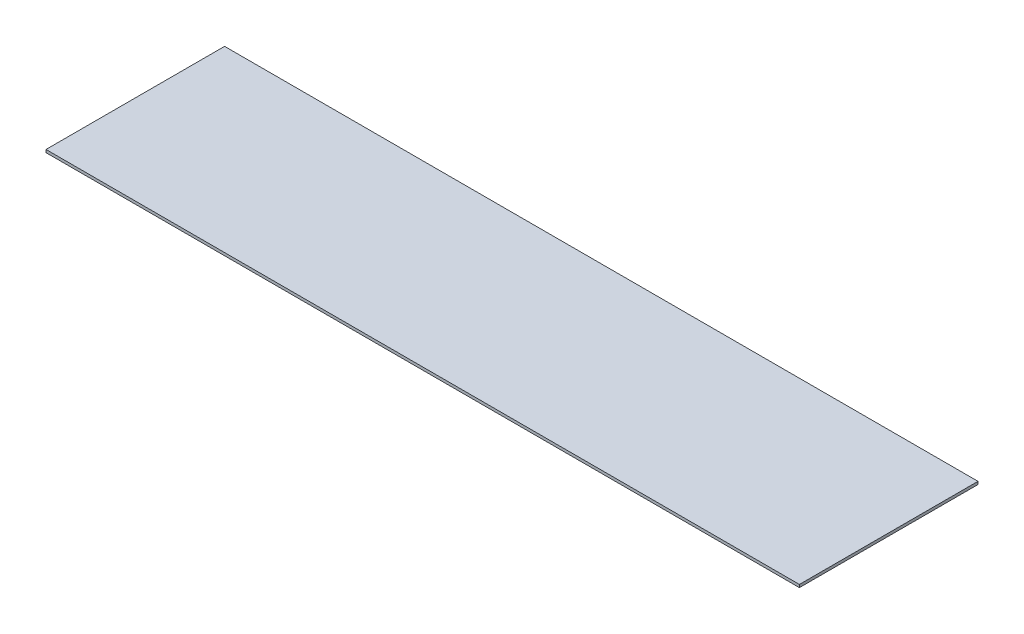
from build123d import *

# Parameters (mm, degrees)
ESQUISSE1_W      = 270
ESQUISSE1_H      = 1
EXTRUSION1_DEPTH = 64


with BuildPart() as part:
    # Esquisse1 → Extrusion1 (new body)
    with BuildSketch(Plane.XY):
        with Locations((135, 0.5)):
            Rectangle(ESQUISSE1_W, ESQUISSE1_H)
    extrude(amount=-EXTRUSION1_DEPTH)


solid = part.part
